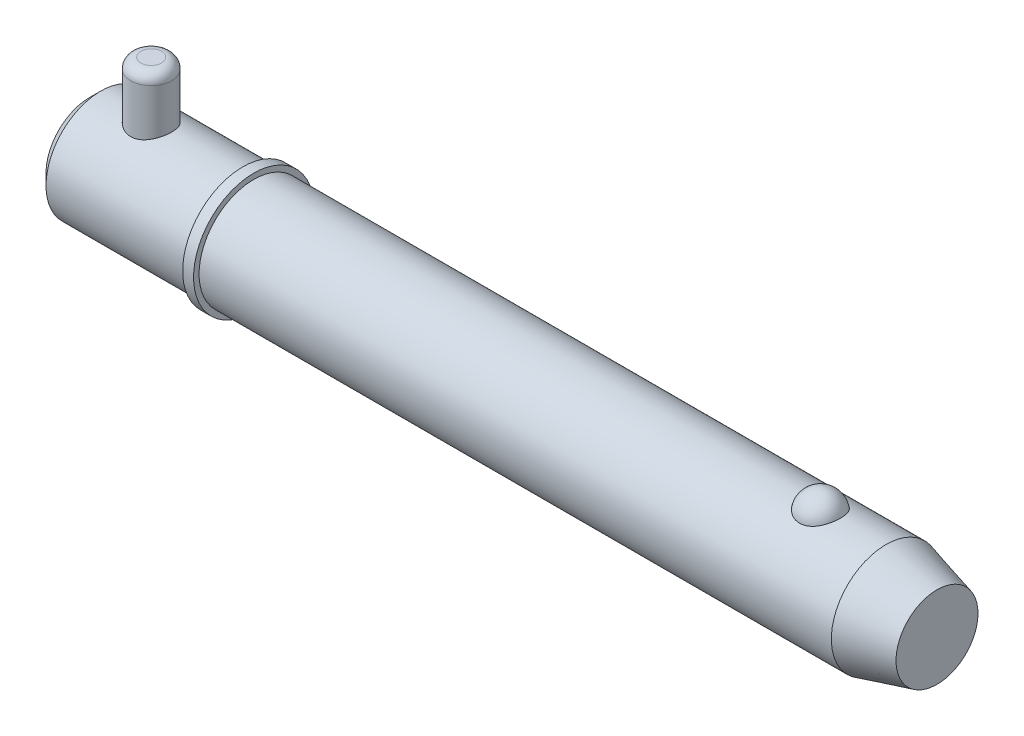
ISO-10303-21;
HEADER;
FILE_DESCRIPTION(('STEP AP214'),'2;1');
FILE_NAME('part.step','',(''),(''),'','','');
FILE_SCHEMA(('AUTOMOTIVE_DESIGN { 1 0 10303 214 1 1 1 1 }'));
ENDSEC;
DATA;
#1=APPLICATION_CONTEXT('core data for automotive mechanical design processes');
#2=APPLICATION_PROTOCOL_DEFINITION('international standard','automotive_design',2000,#1);
#3=PRODUCT_CONTEXT('',#1,'mechanical');
#4=PRODUCT('Part','Part','',(#3));
#5=PRODUCT_RELATED_PRODUCT_CATEGORY('part','',(#4));
#6=PRODUCT_DEFINITION_FORMATION('','',#4);
#7=PRODUCT_DEFINITION_CONTEXT('part definition',#1,'design');
#8=PRODUCT_DEFINITION('design','',#6,#7);
#9=PRODUCT_DEFINITION_SHAPE('','',#8);
#10=(LENGTH_UNIT() NAMED_UNIT(*) SI_UNIT(.MILLI.,.METRE.));
#11=(NAMED_UNIT(*) PLANE_ANGLE_UNIT() SI_UNIT($,.RADIAN.));
#12=(NAMED_UNIT(*) SI_UNIT($,.STERADIAN.) SOLID_ANGLE_UNIT());
#13=UNCERTAINTY_MEASURE_WITH_UNIT(LENGTH_MEASURE(1.E-05),#10,'distance_accuracy_value','');
#14=(GEOMETRIC_REPRESENTATION_CONTEXT(3) GLOBAL_UNCERTAINTY_ASSIGNED_CONTEXT((#13)) GLOBAL_UNIT_ASSIGNED_CONTEXT((#10,
#11,#12)) REPRESENTATION_CONTEXT('',''));
#15=CARTESIAN_POINT('',(0.,0.,0.));
#16=DIRECTION('',(0.,0.,1.));
#17=DIRECTION('',(1.,0.,0.));
#18=AXIS2_PLACEMENT_3D('',#15,#16,#17);
#19=CARTESIAN_POINT('',(14.28,25.4,0.));
#20=DIRECTION('',(0.,-1.,0.));
#21=DIRECTION('',(0.,0.,-1.));
#22=AXIS2_PLACEMENT_3D('',#19,#20,#21);
#23=CYLINDRICAL_SURFACE('',#22,4.76);
#24=CARTESIAN_POINT('',(14.28,-10.32,0.));
#25=DIRECTION('',(0.,1.,0.));
#26=DIRECTION('',(0.,0.,1.));
#27=AXIS2_PLACEMENT_3D('',#24,#25,#26);
#28=CIRCLE('',#27,4.76);
#29=CARTESIAN_POINT('',(14.28,-10.32,-4.76));
#30=VERTEX_POINT('',#29);
#31=EDGE_CURVE('P0_E25',#30,#30,#28,.T.);
#32=CARTESIAN_POINT('',(14.28,23.02,0.));
#33=DIRECTION('',(0.,1.,0.));
#34=DIRECTION('',(0.,0.,1.));
#35=AXIS2_PLACEMENT_3D('',#32,#33,#34);
#36=CIRCLE('',#35,4.76);
#37=CARTESIAN_POINT('',(14.28,23.02,-4.76));
#38=VERTEX_POINT('',#37);
#39=EDGE_CURVE('P0_E29',#38,#38,#36,.F.);
#40=CARTESIAN_POINT('',(14.28,-10.32,-4.76));
#41=CARTESIAN_POINT('',(14.28,-9.97270833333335,-4.76));
#42=CARTESIAN_POINT('',(14.28,-9.62541666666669,-4.76));
#43=CARTESIAN_POINT('',(14.28,-8.93083333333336,-4.76));
#44=CARTESIAN_POINT('',(14.28,-8.58354166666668,-4.76));
#45=CARTESIAN_POINT('',(14.28,-7.88895833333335,-4.76));
#46=CARTESIAN_POINT('',(14.28,-7.54166666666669,-4.76));
#47=CARTESIAN_POINT('',(14.28,-6.84708333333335,-4.76));
#48=CARTESIAN_POINT('',(14.28,-6.49979166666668,-4.76));
#49=CARTESIAN_POINT('',(14.28,-5.80520833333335,-4.76));
#50=CARTESIAN_POINT('',(14.28,-5.45791666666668,-4.76));
#51=CARTESIAN_POINT('',(14.28,-4.76333333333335,-4.76));
#52=CARTESIAN_POINT('',(14.28,-4.41604166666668,-4.76));
#53=CARTESIAN_POINT('',(14.28,-3.72145833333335,-4.76));
#54=CARTESIAN_POINT('',(14.28,-3.37416666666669,-4.76));
#55=CARTESIAN_POINT('',(14.28,-2.67958333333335,-4.76));
#56=CARTESIAN_POINT('',(14.28,-2.33229166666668,-4.76));
#57=CARTESIAN_POINT('',(14.28,-1.63770833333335,-4.76));
#58=CARTESIAN_POINT('',(14.28,-1.29041666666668,-4.76));
#59=CARTESIAN_POINT('',(14.28,-0.595833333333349,-4.76));
#60=CARTESIAN_POINT('',(14.28,-0.24854166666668,-4.76));
#61=CARTESIAN_POINT('',(14.28,0.446041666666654,-4.76));
#62=CARTESIAN_POINT('',(14.28,0.793333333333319,-4.76));
#63=CARTESIAN_POINT('',(14.28,1.48791666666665,-4.76));
#64=CARTESIAN_POINT('',(14.28,1.83520833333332,-4.76));
#65=CARTESIAN_POINT('',(14.28,2.52979166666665,-4.76));
#66=CARTESIAN_POINT('',(14.28,2.87708333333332,-4.76));
#67=CARTESIAN_POINT('',(14.28,3.57166666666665,-4.76));
#68=CARTESIAN_POINT('',(14.28,3.91895833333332,-4.76));
#69=CARTESIAN_POINT('',(14.28,4.61354166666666,-4.76));
#70=CARTESIAN_POINT('',(14.28,4.96083333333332,-4.76));
#71=CARTESIAN_POINT('',(14.28,5.65541666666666,-4.76));
#72=CARTESIAN_POINT('',(14.28,6.00270833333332,-4.76));
#73=CARTESIAN_POINT('',(14.28,6.69729166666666,-4.76));
#74=CARTESIAN_POINT('',(14.28,7.04458333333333,-4.76));
#75=CARTESIAN_POINT('',(14.28,7.73916666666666,-4.76));
#76=CARTESIAN_POINT('',(14.28,8.08645833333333,-4.76));
#77=CARTESIAN_POINT('',(14.28,8.78104166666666,-4.76));
#78=CARTESIAN_POINT('',(14.28,9.12833333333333,-4.76));
#79=CARTESIAN_POINT('',(14.28,9.82291666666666,-4.76));
#80=CARTESIAN_POINT('',(14.28,10.1702083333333,-4.76));
#81=CARTESIAN_POINT('',(14.28,10.8647916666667,-4.76));
#82=CARTESIAN_POINT('',(14.28,11.2120833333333,-4.76));
#83=CARTESIAN_POINT('',(14.28,11.9066666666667,-4.76));
#84=CARTESIAN_POINT('',(14.28,12.2539583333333,-4.76));
#85=CARTESIAN_POINT('',(14.28,12.9485416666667,-4.76));
#86=CARTESIAN_POINT('',(14.28,13.2958333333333,-4.76));
#87=CARTESIAN_POINT('',(14.28,13.9904166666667,-4.76));
#88=CARTESIAN_POINT('',(14.28,14.3377083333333,-4.76));
#89=CARTESIAN_POINT('',(14.28,15.0322916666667,-4.76));
#90=CARTESIAN_POINT('',(14.28,15.3795833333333,-4.76));
#91=CARTESIAN_POINT('',(14.28,16.0741666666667,-4.76));
#92=CARTESIAN_POINT('',(14.28,16.4214583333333,-4.76));
#93=CARTESIAN_POINT('',(14.28,17.1160416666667,-4.76));
#94=CARTESIAN_POINT('',(14.28,17.4633333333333,-4.76));
#95=CARTESIAN_POINT('',(14.28,18.1579166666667,-4.76));
#96=CARTESIAN_POINT('',(14.28,18.5052083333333,-4.76));
#97=CARTESIAN_POINT('',(14.28,19.1997916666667,-4.76));
#98=CARTESIAN_POINT('',(14.28,19.5470833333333,-4.76));
#99=CARTESIAN_POINT('',(14.28,20.2416666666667,-4.76));
#100=CARTESIAN_POINT('',(14.28,20.5889583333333,-4.76));
#101=CARTESIAN_POINT('',(14.28,21.2835416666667,-4.76));
#102=CARTESIAN_POINT('',(14.28,21.6308333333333,-4.76));
#103=CARTESIAN_POINT('',(14.28,22.3254166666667,-4.76));
#104=CARTESIAN_POINT('',(14.28,22.6727083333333,-4.76));
#105=CARTESIAN_POINT('',(14.28,23.02,-4.76));
#106=B_SPLINE_CURVE_WITH_KNOTS('',3,(#40,#41,#42,#43,#44,#45,#46,#47,#48,#49,#50,#51,#52,#53,
#54,#55,#56,#57,#58,#59,#60,#61,#62,#63,#64,#65,#66,#67,#68,#69,#70,#71,#72,#73,#74,#75,#76,#77,
#78,#79,#80,#81,#82,#83,#84,#85,#86,#87,#88,#89,#90,#91,#92,#93,#94,#95,#96,#97,#98,#99,#100,
#101,#102,#103,#104,#105),.UNSPECIFIED.,.F.,.F.,(4,2,2,2,2,2,2,2,2,2,2,2,2,2,2,2,2,2,2,2,2,2,2,
2,2,2,2,2,2,2,2,2,4),(0.,1.041875,2.08375,3.125625,4.1675,5.209375,6.25125,7.293125,
8.33500000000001,9.376875,10.41875,11.460625,12.5025,13.544375,14.58625,15.628125,16.67,
17.711875,18.75375,19.795625,20.8375,21.879375,22.92125,23.963125,25.005,26.046875,27.08875,
28.130625,29.1725,30.214375,31.25625,32.298125,33.34),.UNSPECIFIED.);
#107=EDGE_CURVE('P0_BSEAM14',#30,#38,#106,.T.);
#108=ORIENTED_EDGE('',*,*,#31,.T.);
#109=ORIENTED_EDGE('',*,*,#39,.T.);
#110=ORIENTED_EDGE('',*,*,#107,.T.);
#111=ORIENTED_EDGE('',*,*,#107,.F.);
#112=EDGE_LOOP('',(#108,#110,#109,#111));
#113=FACE_BOUND('',#112,.T.);
#114=ADVANCED_FACE('P0_F14',(#113),#23,.T.);
#115=CARTESIAN_POINT('',(14.28,25.4,0.));
#116=DIRECTION('',(0.,1.,0.));
#117=DIRECTION('',(0.,0.,1.));
#118=AXIS2_PLACEMENT_3D('',#115,#116,#117);
#119=PLANE('',#118);
#120=CARTESIAN_POINT('',(14.28,25.4,0.));
#121=DIRECTION('',(0.,1.,0.));
#122=DIRECTION('',(0.,0.,1.));
#123=AXIS2_PLACEMENT_3D('',#120,#121,#122);
#124=CIRCLE('',#123,2.38);
#125=CARTESIAN_POINT('',(14.28,25.4,2.38));
#126=VERTEX_POINT('',#125);
#127=EDGE_CURVE('P0_E10',#126,#126,#124,.T.);
#128=ORIENTED_EDGE('',*,*,#127,.T.);
#129=EDGE_LOOP('',(#128));
#130=FACE_BOUND('',#129,.T.);
#131=ADVANCED_FACE('P0_F46',(#130),#119,.T.);
#132=CARTESIAN_POINT('',(14.28,-12.7,0.));
#133=DIRECTION('',(0.,1.,0.));
#134=DIRECTION('',(0.,0.,1.));
#135=AXIS2_PLACEMENT_3D('',#132,#133,#134);
#136=PLANE('',#135);
#137=CARTESIAN_POINT('',(14.28,-12.7,0.));
#138=DIRECTION('',(0.,1.,0.));
#139=DIRECTION('',(0.,0.,1.));
#140=AXIS2_PLACEMENT_3D('',#137,#138,#139);
#141=CIRCLE('',#140,2.38);
#142=CARTESIAN_POINT('',(14.28,-12.7,2.38));
#143=VERTEX_POINT('',#142);
#144=EDGE_CURVE('P0_E21',#143,#143,#141,.F.);
#145=ORIENTED_EDGE('',*,*,#144,.T.);
#146=EDGE_LOOP('',(#145));
#147=FACE_BOUND('',#146,.T.);
#148=ADVANCED_FACE('P0_F43',(#147),#136,.F.);
#149=CARTESIAN_POINT('',(14.28,-10.32,0.));
#150=DIRECTION('',(0.,1.,0.));
#151=DIRECTION('',(0.,0.,1.));
#152=AXIS2_PLACEMENT_3D('',#149,#150,#151);
#153=DEGENERATE_TOROIDAL_SURFACE('',#152,2.38,2.38,.T.);
#154=ORIENTED_EDGE('',*,*,#144,.F.);
#155=EDGE_LOOP('',(#154));
#156=FACE_BOUND('',#155,.T.);
#157=ORIENTED_EDGE('',*,*,#31,.F.);
#158=EDGE_LOOP('',(#157));
#159=FACE_BOUND('',#158,.T.);
#160=ADVANCED_FACE('P0_F38',(#156,#159),#153,.T.);
#161=CARTESIAN_POINT('',(14.28,23.02,0.));
#162=DIRECTION('',(0.,1.,0.));
#163=DIRECTION('',(0.,0.,1.));
#164=AXIS2_PLACEMENT_3D('',#161,#162,#163);
#165=DEGENERATE_TOROIDAL_SURFACE('',#164,2.38,2.38,.T.);
#166=ORIENTED_EDGE('',*,*,#39,.F.);
#167=EDGE_LOOP('',(#166));
#168=FACE_BOUND('',#167,.T.);
#169=ORIENTED_EDGE('',*,*,#127,.F.);
#170=EDGE_LOOP('',(#169));
#171=FACE_BOUND('',#170,.T.);
#172=ADVANCED_FACE('P0_F16',(#168,#171),#165,.T.);
#173=CLOSED_SHELL('',(#114,#131,#148,#160,#172));
#174=MANIFOLD_SOLID_BREP('P0_B1',#173);
#175=CARTESIAN_POINT('',(0.,0.,0.));
#176=DIRECTION('',(1.,0.,0.));
#177=DIRECTION('',(0.,0.,-1.));
#178=AXIS2_PLACEMENT_3D('',#175,#176,#177);
#179=CYLINDRICAL_SURFACE('',#178,12.7);
#180=CARTESIAN_POINT('',(185.000738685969,0.,0.));
#181=DIRECTION('',(1.,0.,0.));
#182=DIRECTION('',(0.,0.,-1.));
#183=AXIS2_PLACEMENT_3D('',#180,#181,#182);
#184=CIRCLE('',#183,12.7);
#185=CARTESIAN_POINT('',(185.000738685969,0.,-12.7));
#186=VERTEX_POINT('',#185);
#187=EDGE_CURVE('P1_E81',#186,#186,#184,.T.);
#188=ORIENTED_EDGE('',*,*,#187,.F.);
#189=EDGE_LOOP('',(#188));
#190=FACE_BOUND('',#189,.T.);
#191=CARTESIAN_POINT('',(38.1,0.,0.));
#192=DIRECTION('',(1.,0.,0.));
#193=DIRECTION('',(0.,0.,-1.));
#194=AXIS2_PLACEMENT_3D('',#191,#192,#193);
#195=CIRCLE('',#194,12.7);
#196=CARTESIAN_POINT('',(38.1,0.,-12.7));
#197=VERTEX_POINT('',#196);
#198=EDGE_CURVE('P1_E85',#197,#197,#195,.T.);
#199=ORIENTED_EDGE('',*,*,#198,.T.);
#200=EDGE_LOOP('',(#199));
#201=FACE_BOUND('',#200,.T.);
#202=CARTESIAN_POINT('',(169.760042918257,11.7500437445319,4.81938502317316));
#203=CARTESIAN_POINT('',(169.635088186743,11.7500430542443,4.81938571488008));
#204=CARTESIAN_POINT('',(169.510144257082,11.7520975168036,4.81438658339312));
#205=CARTESIAN_POINT('',(169.261142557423,11.760253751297,4.79442904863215));
#206=CARTESIAN_POINT('',(169.137085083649,11.7663568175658,4.77946746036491));
#207=CARTESIAN_POINT('',(168.890901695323,11.7824262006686,4.73971414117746));
#208=CARTESIAN_POINT('',(168.768774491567,11.7923898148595,4.71492928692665));
#209=CARTESIAN_POINT('',(168.527187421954,11.8158938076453,4.65571340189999));
#210=CARTESIAN_POINT('',(168.40772859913,11.8294355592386,4.62127866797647));
#211=CARTESIAN_POINT('',(168.172557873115,11.8596812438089,4.54309502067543));
#212=CARTESIAN_POINT('',(168.056839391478,11.8763792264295,4.49936361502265));
#213=CARTESIAN_POINT('',(167.829653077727,11.9124878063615,4.40287235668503));
#214=CARTESIAN_POINT('',(167.718186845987,11.9318994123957,4.35010914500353));
#215=CARTESIAN_POINT('',(167.391278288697,11.9934256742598,4.17881316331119));
#216=CARTESIAN_POINT('',(167.183127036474,12.038858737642,4.04720756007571));
#217=CARTESIAN_POINT('',(166.785850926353,12.1352173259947,3.74856446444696));
#218=CARTESIAN_POINT('',(166.597443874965,12.1862630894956,3.5806182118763));
#219=CARTESIAN_POINT('',(166.250521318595,12.2875163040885,3.2160075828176));
#220=CARTESIAN_POINT('',(166.092011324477,12.3377235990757,3.01933792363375));
#221=CARTESIAN_POINT('',(165.80168878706,12.4344923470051,2.59291655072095));
#222=CARTESIAN_POINT('',(165.671376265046,12.4807925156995,2.36208286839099));
#223=CARTESIAN_POINT('',(165.449407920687,12.5623454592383,1.88070399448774));
#224=CARTESIAN_POINT('',(165.357755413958,12.5975972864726,1.63015711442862));
#225=CARTESIAN_POINT('',(165.214046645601,12.6538414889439,1.11298869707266));
#226=CARTESIAN_POINT('',(165.162499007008,12.6746503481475,0.846205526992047));
#227=CARTESIAN_POINT('',(165.101977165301,12.699153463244,0.307085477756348));
#228=CARTESIAN_POINT('',(165.093001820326,12.7028481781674,0.0347487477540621));
#229=CARTESIAN_POINT('',(165.117731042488,12.6927785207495,-0.506073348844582));
#230=CARTESIAN_POINT('',(165.151189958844,12.6791146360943,-0.774571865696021));
#231=CARTESIAN_POINT('',(165.259687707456,12.635882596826,-1.30170246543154));
#232=CARTESIAN_POINT('',(165.33472729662,12.606314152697,-1.56033436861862));
#233=CARTESIAN_POINT('',(165.52500006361,12.5342328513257,-2.06083899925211));
#234=CARTESIAN_POINT('',(165.640287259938,12.4917026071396,-2.30268867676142));
#235=CARTESIAN_POINT('',(165.908704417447,12.3981123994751,-2.76259600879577));
#236=CARTESIAN_POINT('',(166.061837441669,12.3470517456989,-2.98065173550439));
#237=CARTESIAN_POINT('',(166.403507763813,12.2416045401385,-3.38786328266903));
#238=CARTESIAN_POINT('',(166.592201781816,12.1872040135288,-3.57688418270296));
#239=CARTESIAN_POINT('',(167.000239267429,12.0814086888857,-3.91941073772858));
#240=CARTESIAN_POINT('',(167.219580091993,12.0300136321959,-4.07291945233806));
#241=CARTESIAN_POINT('',(167.678375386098,11.9373542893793,-4.33691289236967));
#242=CARTESIAN_POINT('',(167.917304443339,11.8958982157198,-4.44824125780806));
#243=CARTESIAN_POINT('',(168.41243761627,11.8268116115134,-4.62881985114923));
#244=CARTESIAN_POINT('',(168.668635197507,11.7991758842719,-4.69808589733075));
#245=CARTESIAN_POINT('',(169.177164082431,11.7622209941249,-4.78983181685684));
#246=CARTESIAN_POINT('',(169.429041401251,11.7520502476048,-4.8144902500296));
#247=CARTESIAN_POINT('',(169.933573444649,11.7485796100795,-4.82295735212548));
#248=CARTESIAN_POINT('',(170.186228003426,11.7552763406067,-4.80677420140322));
#249=CARTESIAN_POINT('',(170.676834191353,11.7842584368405,-4.73525430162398));
#250=CARTESIAN_POINT('',(170.914998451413,11.8060486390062,-4.68116061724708));
#251=CARTESIAN_POINT('',(171.378489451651,11.8622750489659,-4.53678133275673));
#252=CARTESIAN_POINT('',(171.603815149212,11.8967122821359,-4.44649279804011));
#253=CARTESIAN_POINT('',(172.040801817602,11.9754603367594,-4.22987613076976));
#254=CARTESIAN_POINT('',(172.252057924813,12.0199699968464,-4.10280539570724));
#255=CARTESIAN_POINT('',(172.650601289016,12.1138028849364,-3.81685409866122));
#256=CARTESIAN_POINT('',(172.837883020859,12.163127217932,-3.65796622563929));
#257=CARTESIAN_POINT('',(173.193350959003,12.2642343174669,-3.30364864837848));
#258=CARTESIAN_POINT('',(173.360111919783,12.3160165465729,-3.10678783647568));
#259=CARTESIAN_POINT('',(173.659579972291,12.4142566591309,-2.68748409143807));
#260=CARTESIAN_POINT('',(173.792280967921,12.4607135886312,-2.46503658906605));
#261=CARTESIAN_POINT('',(174.024691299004,12.5450236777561,-1.99289519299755));
#262=CARTESIAN_POINT('',(174.123215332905,12.5825557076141,-1.74255918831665));
#263=CARTESIAN_POINT('',(174.279227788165,12.6431720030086,-1.22773734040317));
#264=CARTESIAN_POINT('',(174.336715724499,12.6662560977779,-0.963251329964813));
#265=CARTESIAN_POINT('',(174.409544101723,12.6956486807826,-0.427355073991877));
#266=CARTESIAN_POINT('',(174.424837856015,12.7019385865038,-0.155937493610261));
#267=CARTESIAN_POINT('',(174.412779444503,12.6970201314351,0.385928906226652));
#268=CARTESIAN_POINT('',(174.38542805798,12.6858120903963,0.656377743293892));
#269=CARTESIAN_POINT('',(174.313060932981,12.6568455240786,1.05454017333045));
#270=CARTESIAN_POINT('',(174.283796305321,12.6451962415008,1.18577850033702));
#271=CARTESIAN_POINT('',(174.215022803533,12.6181819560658,1.44513808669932));
#272=CARTESIAN_POINT('',(174.175517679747,12.6028183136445,1.57326046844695));
#273=CARTESIAN_POINT('',(174.086439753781,12.568754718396,1.82554978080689));
#274=CARTESIAN_POINT('',(174.036862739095,12.5500533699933,1.94971503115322));
#275=CARTESIAN_POINT('',(173.92792115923,12.5098093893,2.19314370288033));
#276=CARTESIAN_POINT('',(173.868560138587,12.4882677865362,2.31240887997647));
#277=CARTESIAN_POINT('',(173.73997128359,12.4427679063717,2.5459303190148));
#278=CARTESIAN_POINT('',(173.670688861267,12.4187964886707,2.66015396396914));
#279=CARTESIAN_POINT('',(173.522903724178,12.3691892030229,2.882026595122));
#280=CARTESIAN_POINT('',(173.444404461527,12.3435539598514,2.98967802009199));
#281=CARTESIAN_POINT('',(173.27855022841,12.2912955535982,3.1977438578));
#282=CARTESIAN_POINT('',(173.191191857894,12.2646720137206,3.29815546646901));
#283=CARTESIAN_POINT('',(173.008161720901,12.2111945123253,3.49095035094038));
#284=CARTESIAN_POINT('',(172.912493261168,12.1843406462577,3.58333679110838));
#285=CARTESIAN_POINT('',(172.713627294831,12.1312249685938,3.75922876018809));
#286=CARTESIAN_POINT('',(172.610450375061,12.104961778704,3.84275713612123));
#287=CARTESIAN_POINT('',(172.39701336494,12.0537284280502,4.00056406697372));
#288=CARTESIAN_POINT('',(172.286756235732,12.028757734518,4.07484645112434));
#289=CARTESIAN_POINT('',(172.059755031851,11.9808306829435,4.21367959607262));
#290=CARTESIAN_POINT('',(171.943006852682,11.9578756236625,4.27822410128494));
#291=CARTESIAN_POINT('',(171.70394258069,11.9147184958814,4.39698483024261));
#292=CARTESIAN_POINT('',(171.581628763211,11.894515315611,4.45120522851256));
#293=CARTESIAN_POINT('',(171.322952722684,11.8561129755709,4.55255353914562));
#294=CARTESIAN_POINT('',(171.186223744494,11.8381764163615,4.59884858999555));
#295=CARTESIAN_POINT('',(170.908608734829,11.8069093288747,4.67853897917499));
#296=CARTESIAN_POINT('',(170.767724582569,11.7935767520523,4.71194005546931));
#297=CARTESIAN_POINT('',(170.48309446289,11.7720277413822,4.7655218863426));
#298=CARTESIAN_POINT('',(170.339348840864,11.7638106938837,4.7857042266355));
#299=CARTESIAN_POINT('',(170.050411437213,11.7528195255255,4.81263433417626));
#300=CARTESIAN_POINT('',(169.905219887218,11.7500445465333,4.81938421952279));
#301=CARTESIAN_POINT('',(169.760042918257,11.7500437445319,4.81938502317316));
#302=B_SPLINE_CURVE_WITH_KNOTS('',3,(#202,#203,#204,#205,#206,#207,#208,#209,#210,#211,#212,
#213,#214,#215,#216,#217,#218,#219,#220,#221,#222,#223,#224,#225,#226,#227,#228,#229,#230,#231,
#232,#233,#234,#235,#236,#237,#238,#239,#240,#241,#242,#243,#244,#245,#246,#247,#248,#249,#250,
#251,#252,#253,#254,#255,#256,#257,#258,#259,#260,#261,#262,#263,#264,#265,#266,#267,#268,#269,
#270,#271,#272,#273,#274,#275,#276,#277,#278,#279,#280,#281,#282,#283,#284,#285,#286,#287,#288,
#289,#290,#291,#292,#293,#294,#295,#296,#297,#298,#299,#300,#301),.UNSPECIFIED.,.T.,.F.,(4,2,2,
2,2,2,2,2,2,2,2,2,2,2,2,2,2,2,2,2,2,2,2,2,2,2,2,2,2,2,2,2,2,2,2,2,2,2,2,2,2,2,2,2,2,2,2,2,2,4),
(0.,0.374729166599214,0.749578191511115,1.12416526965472,1.49889629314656,1.87292776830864,
2.24709865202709,2.99481328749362,3.76399449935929,4.53331735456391,5.33683915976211,
6.14042986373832,6.95405296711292,7.76765424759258,8.57656703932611,9.38549455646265,
10.1955119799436,11.0055949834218,11.8193353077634,12.6330054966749,13.4294141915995,
14.2255231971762,14.9815786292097,15.7374826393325,16.4696948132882,17.2019663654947,
17.950197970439,18.6986017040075,19.484470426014,20.2704797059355,21.0815215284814,
21.8925729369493,22.7045213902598,23.5164550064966,23.9209608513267,24.3253187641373,
24.7298461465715,25.1342272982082,25.5409255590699,25.9474719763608,26.3541750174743,
26.760716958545,27.1661834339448,27.5714814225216,27.9770386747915,28.382431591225,
28.8181206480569,29.2536155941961,29.6890582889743,30.1244323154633),.UNSPECIFIED.);
#303=CARTESIAN_POINT('',(169.760042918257,11.7500437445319,4.81938502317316));
#304=VERTEX_POINT('',#303);
#305=EDGE_CURVE('P1_E35',#304,#304,#302,.T.);
#306=ORIENTED_EDGE('',*,*,#305,.T.);
#307=EDGE_LOOP('',(#306));
#308=FACE_BOUND('',#307,.T.);
#309=ADVANCED_FACE('P1_F13',(#190,#201,#308),#179,.T.);
#310=CARTESIAN_POINT('',(0.,0.,0.));
#311=DIRECTION('',(-1.,0.,0.));
#312=DIRECTION('',(0.,0.,1.));
#313=AXIS2_PLACEMENT_3D('',#310,#311,#312);
#314=PLANE('',#313);
#315=CARTESIAN_POINT('',(0.,0.,0.));
#316=DIRECTION('',(1.,0.,0.));
#317=DIRECTION('',(0.,0.,-1.));
#318=AXIS2_PLACEMENT_3D('',#315,#316,#317);
#319=CIRCLE('',#318,10.16);
#320=CARTESIAN_POINT('',(0.,0.,-10.16));
#321=VERTEX_POINT('',#320);
#322=EDGE_CURVE('P1_E9',#321,#321,#319,.T.);
#323=ORIENTED_EDGE('',*,*,#322,.F.);
#324=EDGE_LOOP('',(#323));
#325=FACE_BOUND('',#324,.T.);
#326=ADVANCED_FACE('P1_F15',(#325),#314,.T.);
#327=CARTESIAN_POINT('',(2.53999999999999,0.,0.));
#328=DIRECTION('',(1.,0.,0.));
#329=DIRECTION('',(0.,0.,-1.));
#330=AXIS2_PLACEMENT_3D('',#327,#328,#329);
#331=CONICAL_SURFACE('',#330,12.7,0.78539816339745);
#332=ORIENTED_EDGE('',*,*,#322,.T.);
#333=EDGE_LOOP('',(#332));
#334=FACE_BOUND('',#333,.T.);
#335=CARTESIAN_POINT('',(2.53999999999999,0.,0.));
#336=DIRECTION('',(1.,0.,0.));
#337=DIRECTION('',(0.,0.,-1.));
#338=AXIS2_PLACEMENT_3D('',#335,#336,#337);
#339=CIRCLE('',#338,12.7);
#340=CARTESIAN_POINT('',(2.53999999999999,0.,-12.7));
#341=VERTEX_POINT('',#340);
#342=EDGE_CURVE('P1_E26',#341,#341,#339,.T.);
#343=ORIENTED_EDGE('',*,*,#342,.F.);
#344=EDGE_LOOP('',(#343));
#345=FACE_BOUND('',#344,.T.);
#346=ADVANCED_FACE('P1_F77',(#334,#345),#331,.T.);
#347=CARTESIAN_POINT('',(0.,0.,0.));
#348=DIRECTION('',(1.,0.,0.));
#349=DIRECTION('',(0.,0.,-1.));
#350=AXIS2_PLACEMENT_3D('',#347,#348,#349);
#351=CYLINDRICAL_SURFACE('',#350,12.7);
#352=CARTESIAN_POINT('',(14.28,-11.7742260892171,4.76));
#353=CARTESIAN_POINT('',(14.1514948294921,-11.7742255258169,4.76000061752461));
#354=CARTESIAN_POINT('',(14.0229980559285,-11.7763355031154,4.75479194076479));
#355=CARTESIAN_POINT('',(13.7669369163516,-11.7847043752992,4.73401198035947));
#356=CARTESIAN_POINT('',(13.6393728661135,-11.7909646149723,4.71843733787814));
#357=CARTESIAN_POINT('',(13.386226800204,-11.8074248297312,4.67709434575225));
#358=CARTESIAN_POINT('',(13.2606439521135,-11.8176231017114,4.65133040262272));
#359=CARTESIAN_POINT('',(13.0122434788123,-11.8416347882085,4.58985545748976));
#360=CARTESIAN_POINT('',(12.8894269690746,-11.8554496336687,4.55414051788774));
#361=CARTESIAN_POINT('',(12.6477622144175,-11.8862222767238,4.47320764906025));
#362=CARTESIAN_POINT('',(12.5289037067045,-11.9031710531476,4.4280169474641));
#363=CARTESIAN_POINT('',(12.2955059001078,-11.939736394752,4.32845291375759));
#364=CARTESIAN_POINT('',(12.1809682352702,-11.9593539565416,4.2740761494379));
#365=CARTESIAN_POINT('',(11.8448901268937,-12.0213893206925,4.09777237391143));
#366=CARTESIAN_POINT('',(11.6307077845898,-12.0670135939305,3.9626122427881));
#367=CARTESIAN_POINT('',(11.2179129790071,-12.1641514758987,3.65386230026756));
#368=CARTESIAN_POINT('',(11.0204399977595,-12.2158379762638,3.47881300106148));
#369=CARTESIAN_POINT('',(10.6568212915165,-12.3178468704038,3.09829182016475));
#370=CARTESIAN_POINT('',(10.4906822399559,-12.3681689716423,2.89281347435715));
#371=CARTESIAN_POINT('',(10.1890299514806,-12.4638367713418,2.44867909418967));
#372=CARTESIAN_POINT('',(10.054749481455,-12.5089552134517,2.20913281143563));
#373=CARTESIAN_POINT('',(9.82886079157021,-12.5870472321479,1.70885919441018));
#374=CARTESIAN_POINT('',(9.73723778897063,-12.620025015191,1.44813923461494));
#375=CARTESIAN_POINT('',(9.60324488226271,-12.6688874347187,0.9248423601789));
#376=CARTESIAN_POINT('',(9.55892269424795,-12.6854474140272,0.662829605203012));
#377=CARTESIAN_POINT('',(9.5145335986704,-12.7020320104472,0.134596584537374));
#378=CARTESIAN_POINT('',(9.5144523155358,-12.7020619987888,-0.131622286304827));
#379=CARTESIAN_POINT('',(9.55741019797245,-12.6860129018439,-0.646717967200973));
#380=CARTESIAN_POINT('',(9.59831845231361,-12.6707298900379,-0.895801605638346));
#381=CARTESIAN_POINT('',(9.71850987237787,-12.6268158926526,-1.38327219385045));
#382=CARTESIAN_POINT('',(9.79779575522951,-12.5981839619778,-1.62165838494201));
#383=CARTESIAN_POINT('',(9.99348296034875,-12.5298894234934,-2.08508424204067));
#384=CARTESIAN_POINT('',(10.110407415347,-12.4900724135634,-2.30987931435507));
#385=CARTESIAN_POINT('',(10.3775896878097,-12.4034373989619,-2.7372158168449));
#386=CARTESIAN_POINT('',(10.5278582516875,-12.3566171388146,-2.93975004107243));
#387=CARTESIAN_POINT('',(10.8677318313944,-12.257571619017,-3.32936830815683));
#388=CARTESIAN_POINT('',(11.0591227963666,-12.2051903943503,-3.51485714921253));
#389=CARTESIAN_POINT('',(11.4706087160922,-12.1031155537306,-3.85170663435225));
#390=CARTESIAN_POINT('',(11.6907108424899,-12.0534226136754,-4.00305872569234));
#391=CARTESIAN_POINT('',(12.1596597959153,-11.9613684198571,-4.27038218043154));
#392=CARTESIAN_POINT('',(12.4090353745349,-11.9191939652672,-4.38549550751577));
#393=CARTESIAN_POINT('',(12.9256290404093,-11.8491124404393,-4.57149117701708));
#394=CARTESIAN_POINT('',(13.1928371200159,-11.8211974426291,-4.64239810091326));
#395=CARTESIAN_POINT('',(13.7217488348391,-11.7846654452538,-4.73434137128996));
#396=CARTESIAN_POINT('',(13.9829438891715,-11.7750694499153,-4.75791141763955));
#397=CARTESIAN_POINT('',(14.5056760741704,-11.7734909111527,-4.76182097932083));
#398=CARTESIAN_POINT('',(14.7672131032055,-11.7815039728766,-4.74217128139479));
#399=CARTESIAN_POINT('',(15.2702140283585,-11.8132466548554,-4.66249544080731));
#400=CARTESIAN_POINT('',(15.5120417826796,-11.8362133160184,-4.60442726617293));
#401=CARTESIAN_POINT('',(15.9824097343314,-11.8943704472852,-4.45202868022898));
#402=CARTESIAN_POINT('',(16.2109472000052,-11.9295634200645,-4.35769084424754));
#403=CARTESIAN_POINT('',(16.6577741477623,-12.0098310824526,-4.13144368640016));
#404=CARTESIAN_POINT('',(16.8753590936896,-12.055226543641,-3.99825937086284));
#405=CARTESIAN_POINT('',(17.2859732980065,-12.150238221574,-3.69949845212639));
#406=CARTESIAN_POINT('',(17.4789935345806,-12.19985597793,-3.5339100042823));
#407=CARTESIAN_POINT('',(17.8477707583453,-12.3015434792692,-3.1624728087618));
#408=CARTESIAN_POINT('',(18.0216609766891,-12.3535695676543,-2.95473880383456));
#409=CARTESIAN_POINT('',(18.254545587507,-12.426745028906,-2.62277433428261));
#410=CARTESIAN_POINT('',(18.3275489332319,-12.4503382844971,-2.50865480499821));
#411=CARTESIAN_POINT('',(18.463723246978,-12.4952713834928,-2.27428971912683));
#412=CARTESIAN_POINT('',(18.5268984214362,-12.5166121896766,-2.15404681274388));
#413=CARTESIAN_POINT('',(18.6427140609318,-12.5563817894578,-1.90858448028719));
#414=CARTESIAN_POINT('',(18.6953855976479,-12.5748191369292,-1.78338108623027));
#415=CARTESIAN_POINT('',(18.7899337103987,-12.6083284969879,-1.52857834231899));
#416=CARTESIAN_POINT('',(18.8318147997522,-12.6234019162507,-1.39898085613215));
#417=CARTESIAN_POINT('',(18.9043819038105,-12.6497495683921,-1.13633254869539));
#418=CARTESIAN_POINT('',(18.9350698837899,-12.6610244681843,-1.00328233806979));
#419=CARTESIAN_POINT('',(18.9849303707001,-12.6794412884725,-0.734761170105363));
#420=CARTESIAN_POINT('',(19.0041035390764,-12.6865834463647,-0.59929035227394));
#421=CARTESIAN_POINT('',(19.0299427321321,-12.6962286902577,-0.335006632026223));
#422=CARTESIAN_POINT('',(19.0372742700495,-12.698978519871,-0.206267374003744));
#423=CARTESIAN_POINT('',(19.0414668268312,-12.7005496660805,0.0514515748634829));
#424=CARTESIAN_POINT('',(19.038324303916,-12.69936965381,0.180431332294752));
#425=CARTESIAN_POINT('',(19.0215965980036,-12.6931114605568,0.437551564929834));
#426=CARTESIAN_POINT('',(19.0080165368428,-12.6880351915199,0.565692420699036));
#427=CARTESIAN_POINT('',(18.9705519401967,-12.6741222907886,0.820297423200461));
#428=CARTESIAN_POINT('',(18.9466635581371,-12.665284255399,0.946760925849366));
#429=CARTESIAN_POINT('',(18.8895279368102,-12.6443449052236,1.19395899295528));
#430=CARTESIAN_POINT('',(18.8565273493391,-12.6323299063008,1.3147578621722));
#431=CARTESIAN_POINT('',(18.781239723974,-12.6052503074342,1.55308888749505));
#432=CARTESIAN_POINT('',(18.738949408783,-12.5901846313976,1.67061987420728));
#433=CARTESIAN_POINT('',(18.5986461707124,-12.5409473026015,2.01714406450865));
#434=CARTESIAN_POINT('',(18.4871532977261,-12.502717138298,2.24027279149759));
#435=CARTESIAN_POINT('',(18.2262440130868,-12.4173042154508,2.6742599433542));
#436=CARTESIAN_POINT('',(18.0754310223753,-12.3698127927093,2.88420891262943));
#437=CARTESIAN_POINT('',(17.7421836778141,-12.271667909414,3.27675114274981));
#438=CARTESIAN_POINT('',(17.5597380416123,-12.2210133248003,3.45933459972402));
#439=CARTESIAN_POINT('',(17.2605468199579,-12.1452079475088,3.7138066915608));
#440=CARTESIAN_POINT('',(17.1535518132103,-12.119328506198,3.79719993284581));
#441=CARTESIAN_POINT('',(16.9326449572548,-12.0688597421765,3.95467398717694));
#442=CARTESIAN_POINT('',(16.8187356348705,-12.0442699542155,4.02875817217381));
#443=CARTESIAN_POINT('',(16.5846234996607,-11.9971053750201,4.16711104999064));
#444=CARTESIAN_POINT('',(16.4644172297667,-11.9745317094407,4.23137427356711));
#445=CARTESIAN_POINT('',(16.2185866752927,-11.9321360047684,4.34949041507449));
#446=CARTESIAN_POINT('',(16.09296473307,-11.9123127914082,4.40334777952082));
#447=CARTESIAN_POINT('',(15.8314769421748,-11.875268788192,4.50232278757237));
#448=CARTESIAN_POINT('',(15.6954035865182,-11.8582009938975,4.54695127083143));
#449=CARTESIAN_POINT('',(15.4194002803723,-11.8284328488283,4.62383807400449));
#450=CARTESIAN_POINT('',(15.2794720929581,-11.815730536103,4.6561019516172));
#451=CARTESIAN_POINT('',(14.9969657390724,-11.7951940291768,4.70788444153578));
#452=CARTESIAN_POINT('',(14.8543884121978,-11.7873583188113,4.72740702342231));
#453=CARTESIAN_POINT('',(14.5678704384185,-11.7768749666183,4.75346370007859));
#454=CARTESIAN_POINT('',(14.4239299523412,-11.7742267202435,4.75999930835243));
#455=CARTESIAN_POINT('',(14.28,-11.7742260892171,4.76));
#456=B_SPLINE_CURVE_WITH_KNOTS('',3,(#352,#353,#354,#355,#356,#357,#358,#359,#360,#361,#362,
#363,#364,#365,#366,#367,#368,#369,#370,#371,#372,#373,#374,#375,#376,#377,#378,#379,#380,#381,
#382,#383,#384,#385,#386,#387,#388,#389,#390,#391,#392,#393,#394,#395,#396,#397,#398,#399,#400,
#401,#402,#403,#404,#405,#406,#407,#408,#409,#410,#411,#412,#413,#414,#415,#416,#417,#418,#419,
#420,#421,#422,#423,#424,#425,#426,#427,#428,#429,#430,#431,#432,#433,#434,#435,#436,#437,#438,
#439,#440,#441,#442,#443,#444,#445,#446,#447,#448,#449,#450,#451,#452,#453,#454,#455),
.UNSPECIFIED.,.T.,.F.,(4,2,2,2,2,2,2,2,2,2,2,2,2,2,2,2,2,2,2,2,2,2,2,2,2,2,2,2,2,2,2,2,2,2,2,2,
2,2,2,2,2,2,2,2,2,2,2,2,2,2,2,4),(0.,0.385378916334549,0.770882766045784,1.15622008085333,
1.54171009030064,1.92610725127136,2.31064835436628,3.07917291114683,3.88239385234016,
4.68578566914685,5.51648193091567,6.34689010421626,7.14151420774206,7.93588010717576,
8.69098665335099,9.44614666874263,10.2122918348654,10.9786842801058,11.789876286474,
12.6012713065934,13.4306405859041,14.2595482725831,15.0427613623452,15.8257790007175,
16.5716820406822,17.3177378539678,18.0917395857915,18.8660247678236,19.6893332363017,
20.1014571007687,20.5134040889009,20.9241137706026,21.3346513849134,21.7451168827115,
22.1555587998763,22.542011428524,22.928594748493,23.3149884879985,23.7015265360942,
24.0784835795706,24.4555738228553,25.2091300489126,25.994347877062,26.7798463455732,
27.1937428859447,27.6074890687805,28.0214648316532,28.4352633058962,28.8672794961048,
29.299101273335,29.7307884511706,30.1624253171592),.UNSPECIFIED.);
#457=CARTESIAN_POINT('',(14.28,-11.7742260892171,4.76));
#458=VERTEX_POINT('',#457);
#459=EDGE_CURVE('P1_E17',#458,#458,#456,.T.);
#460=ORIENTED_EDGE('',*,*,#459,.F.);
#461=EDGE_LOOP('',(#460));
#462=FACE_BOUND('',#461,.T.);
#463=CARTESIAN_POINT('',(14.28,11.7742260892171,4.76));
#464=CARTESIAN_POINT('',(14.4085051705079,11.7742255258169,4.76000061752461));
#465=CARTESIAN_POINT('',(14.5370019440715,11.7763355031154,4.75479194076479));
#466=CARTESIAN_POINT('',(14.7930630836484,11.7847043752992,4.73401198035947));
#467=CARTESIAN_POINT('',(14.9206271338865,11.7909646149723,4.71843733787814));
#468=CARTESIAN_POINT('',(15.173773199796,11.8074248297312,4.67709434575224));
#469=CARTESIAN_POINT('',(15.2993560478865,11.8176231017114,4.65133040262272));
#470=CARTESIAN_POINT('',(15.5477565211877,11.8416347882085,4.58985545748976));
#471=CARTESIAN_POINT('',(15.6705730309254,11.8554496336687,4.55414051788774));
#472=CARTESIAN_POINT('',(15.9122377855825,11.8862222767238,4.47320764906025));
#473=CARTESIAN_POINT('',(16.0310962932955,11.9031710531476,4.4280169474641));
#474=CARTESIAN_POINT('',(16.2644940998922,11.939736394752,4.32845291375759));
#475=CARTESIAN_POINT('',(16.3790317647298,11.9593539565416,4.2740761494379));
#476=CARTESIAN_POINT('',(16.7151098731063,12.0213893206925,4.09777237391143));
#477=CARTESIAN_POINT('',(16.9292922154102,12.0670135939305,3.96261224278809));
#478=CARTESIAN_POINT('',(17.3420870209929,12.1641514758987,3.65386230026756));
#479=CARTESIAN_POINT('',(17.5395600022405,12.2158379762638,3.47881300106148));
#480=CARTESIAN_POINT('',(17.9031787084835,12.3178468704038,3.09829182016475));
#481=CARTESIAN_POINT('',(18.0693177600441,12.3681689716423,2.89281347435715));
#482=CARTESIAN_POINT('',(18.3709700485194,12.4638367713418,2.44867909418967));
#483=CARTESIAN_POINT('',(18.505250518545,12.5089552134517,2.20913281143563));
#484=CARTESIAN_POINT('',(18.7311392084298,12.5870472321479,1.70885919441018));
#485=CARTESIAN_POINT('',(18.8227622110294,12.620025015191,1.44813923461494));
#486=CARTESIAN_POINT('',(18.9567551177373,12.6688874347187,0.924842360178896));
#487=CARTESIAN_POINT('',(19.0010773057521,12.6854474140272,0.662829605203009));
#488=CARTESIAN_POINT('',(19.0454664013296,12.7020320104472,0.134596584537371));
#489=CARTESIAN_POINT('',(19.0455476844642,12.7020619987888,-0.13162228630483));
#490=CARTESIAN_POINT('',(19.0025898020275,12.6860129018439,-0.646717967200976));
#491=CARTESIAN_POINT('',(18.9616815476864,12.6707298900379,-0.89580160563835));
#492=CARTESIAN_POINT('',(18.8414901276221,12.6268158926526,-1.38327219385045));
#493=CARTESIAN_POINT('',(18.7622042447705,12.5981839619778,-1.62165838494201));
#494=CARTESIAN_POINT('',(18.5665170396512,12.5298894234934,-2.08508424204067));
#495=CARTESIAN_POINT('',(18.449592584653,12.4900724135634,-2.30987931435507));
#496=CARTESIAN_POINT('',(18.1824103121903,12.4034373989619,-2.7372158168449));
#497=CARTESIAN_POINT('',(18.0321417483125,12.3566171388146,-2.93975004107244));
#498=CARTESIAN_POINT('',(17.6922681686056,12.257571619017,-3.32936830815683));
#499=CARTESIAN_POINT('',(17.5008772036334,12.2051903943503,-3.51485714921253));
#500=CARTESIAN_POINT('',(17.0893912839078,12.1031155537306,-3.85170663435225));
#501=CARTESIAN_POINT('',(16.8692891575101,12.0534226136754,-4.00305872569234));
#502=CARTESIAN_POINT('',(16.4003402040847,11.9613684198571,-4.27038218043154));
#503=CARTESIAN_POINT('',(16.1509646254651,11.9191939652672,-4.38549550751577));
#504=CARTESIAN_POINT('',(15.6343709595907,11.8491124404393,-4.57149117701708));
#505=CARTESIAN_POINT('',(15.367162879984,11.8211974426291,-4.64239810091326));
#506=CARTESIAN_POINT('',(14.8382511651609,11.7846654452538,-4.73434137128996));
#507=CARTESIAN_POINT('',(14.5770561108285,11.7750694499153,-4.75791141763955));
#508=CARTESIAN_POINT('',(14.0543239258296,11.7734909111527,-4.76182097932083));
#509=CARTESIAN_POINT('',(13.7927868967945,11.7815039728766,-4.74217128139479));
#510=CARTESIAN_POINT('',(13.2897859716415,11.8132466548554,-4.66249544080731));
#511=CARTESIAN_POINT('',(13.0479582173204,11.8362133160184,-4.60442726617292));
#512=CARTESIAN_POINT('',(12.5775902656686,11.8943704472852,-4.45202868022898));
#513=CARTESIAN_POINT('',(12.3490527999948,11.9295634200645,-4.35769084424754));
#514=CARTESIAN_POINT('',(11.9022258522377,12.0098310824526,-4.13144368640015));
#515=CARTESIAN_POINT('',(11.6846409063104,12.055226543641,-3.99825937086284));
#516=CARTESIAN_POINT('',(11.2740267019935,12.150238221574,-3.69949845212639));
#517=CARTESIAN_POINT('',(11.0810064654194,12.19985597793,-3.5339100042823));
#518=CARTESIAN_POINT('',(10.7122292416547,12.3015434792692,-3.1624728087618));
#519=CARTESIAN_POINT('',(10.5383390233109,12.3535695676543,-2.95473880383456));
#520=CARTESIAN_POINT('',(10.305454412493,12.426745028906,-2.6227743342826));
#521=CARTESIAN_POINT('',(10.2324510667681,12.4503382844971,-2.50865480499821));
#522=CARTESIAN_POINT('',(10.096276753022,12.4952713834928,-2.27428971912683));
#523=CARTESIAN_POINT('',(10.0331015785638,12.5166121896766,-2.15404681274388));
#524=CARTESIAN_POINT('',(9.91728593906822,12.5563817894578,-1.90858448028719));
#525=CARTESIAN_POINT('',(9.8646144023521,12.5748191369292,-1.78338108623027));
#526=CARTESIAN_POINT('',(9.77006628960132,12.6083284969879,-1.52857834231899));
#527=CARTESIAN_POINT('',(9.72818520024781,12.6234019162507,-1.39898085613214));
#528=CARTESIAN_POINT('',(9.65561809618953,12.6497495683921,-1.13633254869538));
#529=CARTESIAN_POINT('',(9.62493011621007,12.6610244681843,-1.00328233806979));
#530=CARTESIAN_POINT('',(9.57506962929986,12.6794412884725,-0.734761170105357));
#531=CARTESIAN_POINT('',(9.55589646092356,12.6865834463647,-0.599290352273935));
#532=CARTESIAN_POINT('',(9.53005726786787,12.6962286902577,-0.335006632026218));
#533=CARTESIAN_POINT('',(9.52272572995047,12.698978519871,-0.20626737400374));
#534=CARTESIAN_POINT('',(9.51853317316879,12.7005496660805,0.0514515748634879));
#535=CARTESIAN_POINT('',(9.52167569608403,12.69936965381,0.180431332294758));
#536=CARTESIAN_POINT('',(9.53840340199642,12.6931114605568,0.43755156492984));
#537=CARTESIAN_POINT('',(9.55198346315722,12.6880351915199,0.565692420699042));
#538=CARTESIAN_POINT('',(9.58944805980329,12.6741222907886,0.820297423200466));
#539=CARTESIAN_POINT('',(9.61333644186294,12.665284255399,0.946760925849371));
#540=CARTESIAN_POINT('',(9.67047206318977,12.6443449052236,1.19395899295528));
#541=CARTESIAN_POINT('',(9.7034726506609,12.6323299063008,1.31475786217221));
#542=CARTESIAN_POINT('',(9.77876027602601,12.6052503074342,1.55308888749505));
#543=CARTESIAN_POINT('',(9.82105059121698,12.5901846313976,1.67061987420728));
#544=CARTESIAN_POINT('',(9.96135382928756,12.5409473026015,2.01714406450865));
#545=CARTESIAN_POINT('',(10.0728467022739,12.502717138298,2.24027279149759));
#546=CARTESIAN_POINT('',(10.3337559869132,12.4173042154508,2.6742599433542));
#547=CARTESIAN_POINT('',(10.4845689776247,12.3698127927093,2.88420891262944));
#548=CARTESIAN_POINT('',(10.8178163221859,12.271667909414,3.27675114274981));
#549=CARTESIAN_POINT('',(11.0002619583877,12.2210133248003,3.45933459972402));
#550=CARTESIAN_POINT('',(11.2994531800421,12.1452079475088,3.7138066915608));
#551=CARTESIAN_POINT('',(11.4064481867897,12.119328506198,3.79719993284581));
#552=CARTESIAN_POINT('',(11.6273550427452,12.0688597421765,3.95467398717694));
#553=CARTESIAN_POINT('',(11.7412643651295,12.0442699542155,4.02875817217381));
#554=CARTESIAN_POINT('',(11.9753765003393,11.9971053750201,4.16711104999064));
#555=CARTESIAN_POINT('',(12.0955827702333,11.9745317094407,4.23137427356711));
#556=CARTESIAN_POINT('',(12.3414133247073,11.9321360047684,4.34949041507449));
#557=CARTESIAN_POINT('',(12.46703526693,11.9123127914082,4.40334777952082));
#558=CARTESIAN_POINT('',(12.7285230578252,11.875268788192,4.50232278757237));
#559=CARTESIAN_POINT('',(12.8645964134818,11.8582009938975,4.54695127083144));
#560=CARTESIAN_POINT('',(13.1405997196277,11.8284328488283,4.62383807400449));
#561=CARTESIAN_POINT('',(13.2805279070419,11.815730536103,4.6561019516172));
#562=CARTESIAN_POINT('',(13.5630342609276,11.7951940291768,4.70788444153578));
#563=CARTESIAN_POINT('',(13.7056115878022,11.7873583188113,4.72740702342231));
#564=CARTESIAN_POINT('',(13.9921295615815,11.7768749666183,4.75346370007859));
#565=CARTESIAN_POINT('',(14.1360700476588,11.7742267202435,4.75999930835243));
#566=CARTESIAN_POINT('',(14.28,11.7742260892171,4.76));
#567=B_SPLINE_CURVE_WITH_KNOTS('',3,(#463,#464,#465,#466,#467,#468,#469,#470,#471,#472,#473,
#474,#475,#476,#477,#478,#479,#480,#481,#482,#483,#484,#485,#486,#487,#488,#489,#490,#491,#492,
#493,#494,#495,#496,#497,#498,#499,#500,#501,#502,#503,#504,#505,#506,#507,#508,#509,#510,#511,
#512,#513,#514,#515,#516,#517,#518,#519,#520,#521,#522,#523,#524,#525,#526,#527,#528,#529,#530,
#531,#532,#533,#534,#535,#536,#537,#538,#539,#540,#541,#542,#543,#544,#545,#546,#547,#548,#549,
#550,#551,#552,#553,#554,#555,#556,#557,#558,#559,#560,#561,#562,#563,#564,#565,#566),
.UNSPECIFIED.,.T.,.F.,(4,2,2,2,2,2,2,2,2,2,2,2,2,2,2,2,2,2,2,2,2,2,2,2,2,2,2,2,2,2,2,2,2,2,2,2,
2,2,2,2,2,2,2,2,2,2,2,2,2,2,2,4),(0.,0.385378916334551,0.770882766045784,1.15622008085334,
1.54171009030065,1.92610725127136,2.31064835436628,3.07917291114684,3.88239385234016,
4.68578566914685,5.51648193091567,6.34689010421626,7.14151420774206,7.93588010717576,
8.690986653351,9.44614666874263,10.2122918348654,10.9786842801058,11.789876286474,
12.6012713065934,13.4306405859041,14.2595482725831,15.0427613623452,15.8257790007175,
16.5716820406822,17.3177378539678,18.0917395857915,18.8660247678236,19.6893332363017,
20.1014571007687,20.5134040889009,20.9241137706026,21.3346513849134,21.7451168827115,
22.1555587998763,22.542011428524,22.928594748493,23.3149884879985,23.7015265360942,
24.0784835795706,24.4555738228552,25.2091300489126,25.994347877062,26.7798463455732,
27.1937428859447,27.6074890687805,28.0214648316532,28.4352633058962,28.8672794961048,
29.299101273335,29.7307884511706,30.1624253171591),.UNSPECIFIED.);
#568=CARTESIAN_POINT('',(14.28,11.7742260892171,4.76));
#569=VERTEX_POINT('',#568);
#570=EDGE_CURVE('P1_E43',#569,#569,#567,.T.);
#571=ORIENTED_EDGE('',*,*,#570,.F.);
#572=EDGE_LOOP('',(#571));
#573=FACE_BOUND('',#572,.T.);
#574=ORIENTED_EDGE('',*,*,#342,.T.);
#575=EDGE_LOOP('',(#574));
#576=FACE_BOUND('',#575,.T.);
#577=CARTESIAN_POINT('',(35.56,0.,0.));
#578=DIRECTION('',(1.,0.,0.));
#579=DIRECTION('',(0.,0.,-1.));
#580=AXIS2_PLACEMENT_3D('',#577,#578,#579);
#581=CIRCLE('',#580,12.7);
#582=CARTESIAN_POINT('',(35.56,0.,-12.7));
#583=VERTEX_POINT('',#582);
#584=EDGE_CURVE('P1_E31',#583,#583,#581,.T.);
#585=ORIENTED_EDGE('',*,*,#584,.F.);
#586=EDGE_LOOP('',(#585));
#587=FACE_BOUND('',#586,.T.);
#588=ADVANCED_FACE('P1_F103',(#462,#573,#576,#587),#351,.T.);
#589=CARTESIAN_POINT('',(35.56,12.7,0.));
#590=DIRECTION('',(-1.,0.,0.));
#591=DIRECTION('',(0.,0.,1.));
#592=AXIS2_PLACEMENT_3D('',#589,#590,#591);
#593=PLANE('',#592);
#594=ORIENTED_EDGE('',*,*,#584,.T.);
#595=EDGE_LOOP('',(#594));
#596=FACE_BOUND('',#595,.T.);
#597=CARTESIAN_POINT('',(35.56,0.,0.));
#598=DIRECTION('',(1.,0.,0.));
#599=DIRECTION('',(0.,0.,-1.));
#600=AXIS2_PLACEMENT_3D('',#597,#598,#599);
#601=CIRCLE('',#600,13.97);
#602=CARTESIAN_POINT('',(35.56,0.,-13.97));
#603=VERTEX_POINT('',#602);
#604=EDGE_CURVE('P1_E91',#603,#603,#601,.T.);
#605=ORIENTED_EDGE('',*,*,#604,.F.);
#606=EDGE_LOOP('',(#605));
#607=FACE_BOUND('',#606,.T.);
#608=ADVANCED_FACE('P1_F100',(#596,#607),#593,.T.);
#609=CARTESIAN_POINT('',(0.,0.,0.));
#610=DIRECTION('',(1.,0.,0.));
#611=DIRECTION('',(0.,0.,-1.));
#612=AXIS2_PLACEMENT_3D('',#609,#610,#611);
#613=CYLINDRICAL_SURFACE('',#612,13.97);
#614=ORIENTED_EDGE('',*,*,#604,.T.);
#615=EDGE_LOOP('',(#614));
#616=FACE_BOUND('',#615,.T.);
#617=CARTESIAN_POINT('',(38.1,0.,0.));
#618=DIRECTION('',(1.,0.,0.));
#619=DIRECTION('',(0.,0.,-1.));
#620=AXIS2_PLACEMENT_3D('',#617,#618,#619);
#621=CIRCLE('',#620,13.97);
#622=CARTESIAN_POINT('',(38.1,0.,-13.97));
#623=VERTEX_POINT('',#622);
#624=EDGE_CURVE('P1_E88',#623,#623,#621,.T.);
#625=ORIENTED_EDGE('',*,*,#624,.F.);
#626=EDGE_LOOP('',(#625));
#627=FACE_BOUND('',#626,.T.);
#628=ADVANCED_FACE('P1_F68',(#616,#627),#613,.T.);
#629=CARTESIAN_POINT('',(38.1,13.97,0.));
#630=DIRECTION('',(1.,0.,0.));
#631=DIRECTION('',(0.,0.,-1.));
#632=AXIS2_PLACEMENT_3D('',#629,#630,#631);
#633=PLANE('',#632);
#634=ORIENTED_EDGE('',*,*,#624,.T.);
#635=EDGE_LOOP('',(#634));
#636=FACE_BOUND('',#635,.T.);
#637=ORIENTED_EDGE('',*,*,#198,.F.);
#638=EDGE_LOOP('',(#637));
#639=FACE_BOUND('',#638,.T.);
#640=ADVANCED_FACE('P1_F62',(#636,#639),#633,.T.);
#641=CARTESIAN_POINT('',(196.85,0.,0.));
#642=DIRECTION('',(-1.,0.,0.));
#643=DIRECTION('',(0.,0.,1.));
#644=AXIS2_PLACEMENT_3D('',#641,#642,#643);
#645=CONICAL_SURFACE('',#644,9.52500000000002,0.26179938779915);
#646=ORIENTED_EDGE('',*,*,#187,.T.);
#647=EDGE_LOOP('',(#646));
#648=FACE_BOUND('',#647,.T.);
#649=CARTESIAN_POINT('',(196.85,0.,0.));
#650=DIRECTION('',(1.,0.,0.));
#651=DIRECTION('',(0.,0.,-1.));
#652=AXIS2_PLACEMENT_3D('',#649,#650,#651);
#653=CIRCLE('',#652,9.52500000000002);
#654=CARTESIAN_POINT('',(196.85,0.,-9.52500000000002));
#655=VERTEX_POINT('',#654);
#656=EDGE_CURVE('P1_E42',#655,#655,#653,.T.);
#657=ORIENTED_EDGE('',*,*,#656,.F.);
#658=EDGE_LOOP('',(#657));
#659=FACE_BOUND('',#658,.T.);
#660=ADVANCED_FACE('P1_F59',(#648,#659),#645,.T.);
#661=CARTESIAN_POINT('',(196.85,9.52500000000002,0.));
#662=DIRECTION('',(1.,0.,0.));
#663=DIRECTION('',(0.,0.,-1.));
#664=AXIS2_PLACEMENT_3D('',#661,#662,#663);
#665=PLANE('',#664);
#666=ORIENTED_EDGE('',*,*,#656,.T.);
#667=EDGE_LOOP('',(#666));
#668=FACE_BOUND('',#667,.T.);
#669=ADVANCED_FACE('P1_F55',(#668),#665,.T.);
#670=CARTESIAN_POINT('',(169.760042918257,11.43,0.));
#671=DIRECTION('',(-1.,0.,0.));
#672=DIRECTION('',(0.,1.,0.));
#673=AXIS2_PLACEMENT_3D('',#670,#671,#672);
#674=SPHERICAL_SURFACE('',#673,4.82999999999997);
#675=ORIENTED_EDGE('',*,*,#305,.F.);
#676=EDGE_LOOP('',(#675));
#677=FACE_BOUND('',#676,.T.);
#678=ADVANCED_FACE('P1_F50',(#677),#674,.T.);
#679=CARTESIAN_POINT('',(14.28,-13.97,0.));
#680=DIRECTION('',(0.,1.,0.));
#681=DIRECTION('',(0.,0.,1.));
#682=AXIS2_PLACEMENT_3D('',#679,#680,#681);
#683=CYLINDRICAL_SURFACE('',#682,4.76);
#684=ORIENTED_EDGE('',*,*,#459,.T.);
#685=EDGE_LOOP('',(#684));
#686=FACE_BOUND('',#685,.T.);
#687=ORIENTED_EDGE('',*,*,#570,.T.);
#688=EDGE_LOOP('',(#687));
#689=FACE_BOUND('',#688,.T.);
#690=ADVANCED_FACE('P1_F54',(#686,#689),#683,.F.);
#691=CLOSED_SHELL('',(#309,#326,#346,#588,#608,#628,#640,#660,#669,#678,#690));
#692=MANIFOLD_SOLID_BREP('P1_B1',#691);
#693=ADVANCED_BREP_SHAPE_REPRESENTATION('',(#18,#174,#692),#14);
#694=SHAPE_DEFINITION_REPRESENTATION(#9,#693);
ENDSEC;
END-ISO-10303-21;
